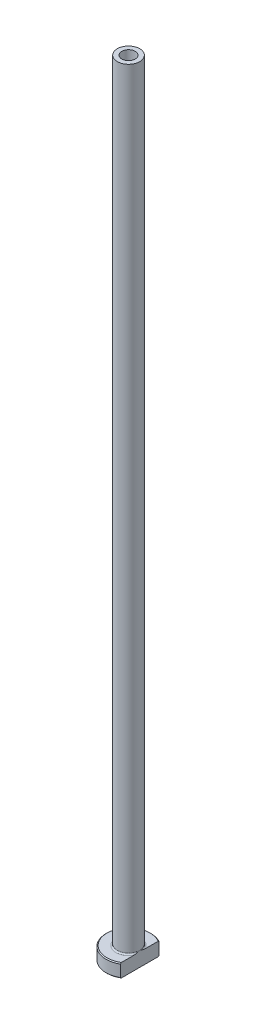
from build123d import *

# Parameters (mm, degrees)
FILLET1_R          = 0.3
CHAMFER1_SIZE      = 0.2
CUT_EXTRUDE1_DEPTH = 176.142798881
CHAMFER2_SIZE      = 0.5


with BuildPart() as part:
    # Sketch1 → Revolve1 (revolve)
    with BuildSketch(Plane.XY, mode=Mode.PRIVATE) as revolve1_sk:
        Polygon((-1.5, 175), (-2.5, 175), (-2.5, 3), (-5, 3), (-5, 0), (-1.75, 0), (-1.75, 118), (-1.5, 130), align=None)
    revolve(revolve1_sk.sketch.rotate(Axis((0, 92.187680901, 0), (0, -1, 0)), 270), axis=Axis((0, 92.187680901, 0), (0, -1, 0)))

    # Fillet1
    fillet1_edges = [part.edges().sort_by_distance(p)[0] for p in [
        (0, 3, -2.5),
    ]]
    fillet(fillet1_edges, radius=FILLET1_R)

    # Chamfer1
    chamfer1_edges = [part.edges().sort_by_distance(p)[0] for p in [
        (0, 0, -5),
        (0, 3, -5),
    ]]
    chamfer(chamfer1_edges, length=CHAMFER1_SIZE)

    # Sketch2 → Cut-Extrude1 (cut, through all)
    with BuildSketch(Plane.XZ):
        with BuildLine():
            Line((2.5, 4.330127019), (2.5, -4.330127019))
            ThreePointArc((2.5, -4.330127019), (5, 0), (2.5, 4.330127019))
        make_face()
    extrude(amount=-CUT_EXTRUDE1_DEPTH, mode=Mode.SUBTRACT)

    # Chamfer2
    chamfer2_edges = [part.edges().sort_by_distance(p)[0] for p in [
        (0, 0, -1.75),
    ]]
    chamfer(chamfer2_edges, length=CHAMFER2_SIZE)


solid = part.part
